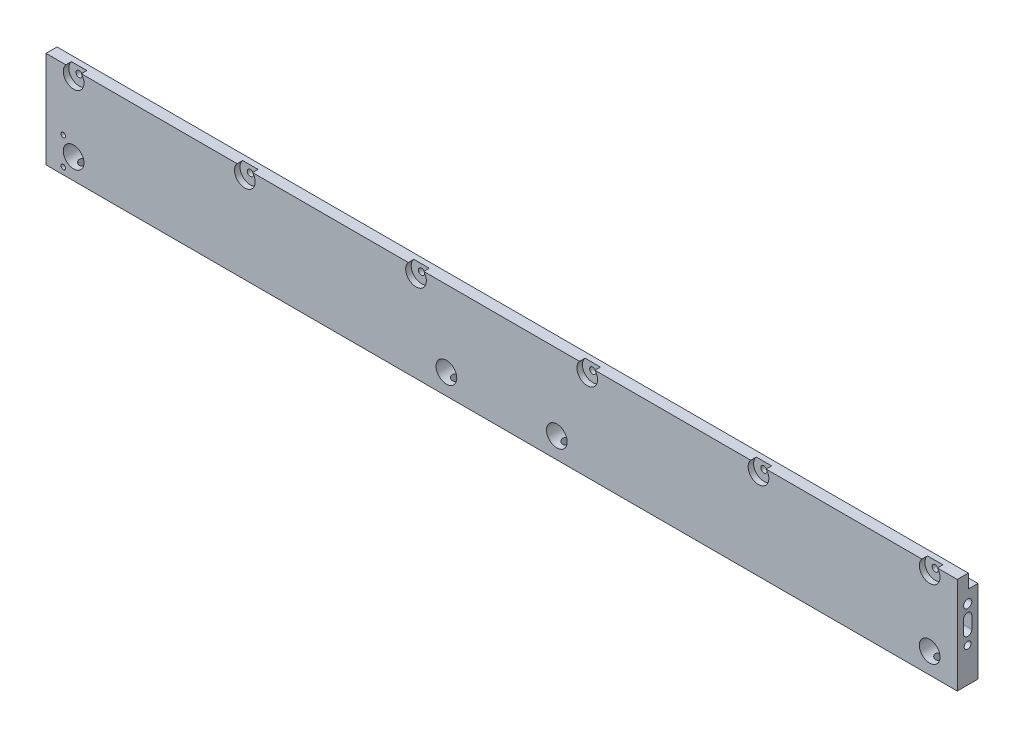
from build123d import *

# Parameters (mm, degrees)
EXTRUSION1_DEPTH                                   = 330
D_GAGEMENT_M61_D                                   = 15
D_GAGEMENT_M61_DEPTH                               = 60
D_GAGEMENT_M61_TIP                                 = 4.506454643
D_GAGEMENT_M62_REACH                               = 339.676
D_GAGEMENT_M62_BORE_R                              = 3.25
TROU_TARAUD_M6X1_01_D                              = 5
TROU_TARAUD_M6X1_01_DEPTH                          = 18
TROU_TARAUD_M6X1_01_TIP                            = 1.502151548
TROU_TARAUD_M4X0_71_D                              = 3.3
CHAMBRAGE_POUR_VIS_T_TE_HEXAGONALE_M61_D           = 4.5
CHAMBRAGE_POUR_VIS_T_TE_HEXAGONALE_M61_CBORE_D     = 15
CHAMBRAGE_POUR_VIS_T_TE_HEXAGONALE_M61_CBORE_DEPTH = 4
ENL_V_MAT_EXTRU_1_REACH                            = 665.871
ESQUISSE12_R                                       = 3
TROU_TARAUD_M6X1_03_D                              = 5
TROU_TARAUD_M6X1_03_DEPTH                          = 9
TROU_TARAUD_M6X1_03_TIP                            = 1.502151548


with BuildPart() as part:
    # Esquisse1 → Extrusion1 (new, symmetric)
    with BuildSketch(Plane(origin=(0, 0, 0), x_dir=(0, 0, -1), z_dir=(1, 0, 0))):
        Polygon((0, 0), (0, 70), (8, 70), (8, 60), (15, 60), (15, 0), align=None)
    extrude(amount=EXTRUSION1_DEPTH, both=True)

    # D_gagement M61
    with Locations(Plane(origin=(0, 0, -15), x_dir=(-1, 0, 0), z_dir=(0, 0, -1))):
        with Locations((-310, 15), (-40, 15), (40, 15), (310, 15)):
            Hole(D_GAGEMENT_M61_D / 2, depth=D_GAGEMENT_M61_DEPTH)
            with Locations((0, 0, -(D_GAGEMENT_M61_DEPTH + D_GAGEMENT_M61_TIP / 2))):  # 118° drill point
                Cone(0, D_GAGEMENT_M61_D / 2, D_GAGEMENT_M61_TIP, mode=Mode.SUBTRACT)

    # D_gagement M62 bore → D_gagement M62 (cut, up to next)
    with BuildSketch(Plane.XZ, mode=Mode.PRIVATE) as d_gagement_m62_sk1:
        with Locations((310, -7.5)):
            Circle(D_GAGEMENT_M62_BORE_R)
    d_gagement_m62_tool1 = extrude(d_gagement_m62_sk1.sketch, amount=-D_GAGEMENT_M62_REACH, mode=Mode.PRIVATE) & part.part
    # D_gagement M62 bore → D_gagement M62 (cut, up to next)
    with BuildSketch(Plane.XZ, mode=Mode.PRIVATE) as d_gagement_m62_sk2:
        with Locations((40, -7.5)):
            Circle(D_GAGEMENT_M62_BORE_R)
    d_gagement_m62_tool2 = extrude(d_gagement_m62_sk2.sketch, amount=-D_GAGEMENT_M62_REACH, mode=Mode.PRIVATE) & part.part
    # D_gagement M62 bore → D_gagement M62 (cut, up to next)
    with BuildSketch(Plane.XZ, mode=Mode.PRIVATE) as d_gagement_m62_sk3:
        with Locations((-40, -7.5)):
            Circle(D_GAGEMENT_M62_BORE_R)
    d_gagement_m62_tool3 = extrude(d_gagement_m62_sk3.sketch, amount=-D_GAGEMENT_M62_REACH, mode=Mode.PRIVATE) & part.part
    # D_gagement M62 bore → D_gagement M62 (cut, up to next)
    with BuildSketch(Plane.XZ, mode=Mode.PRIVATE) as d_gagement_m62_sk4:
        with Locations((-310, -7.5)):
            Circle(D_GAGEMENT_M62_BORE_R)
    d_gagement_m62_tool4 = extrude(d_gagement_m62_sk4.sketch, amount=-D_GAGEMENT_M62_REACH, mode=Mode.PRIVATE) & part.part
    add(d_gagement_m62_tool1.solids().sort_by_distance((310, 0, -7.5))[0], mode=Mode.SUBTRACT)
    add(d_gagement_m62_tool2.solids().sort_by_distance((40, 0, -7.5))[0], mode=Mode.SUBTRACT)
    add(d_gagement_m62_tool3.solids().sort_by_distance((-40, 0, -7.5))[0], mode=Mode.SUBTRACT)
    add(d_gagement_m62_tool4.solids().sort_by_distance((-310, 0, -7.5))[0], mode=Mode.SUBTRACT)

    # Trou taraud_ M6x1.01
    with Locations(Plane(origin=(330, 0, 0), x_dir=(0, 0, -1), z_dir=(1, 0, 0))):
        with Locations((7.5, 25)):
            Hole(TROU_TARAUD_M6X1_01_D / 2, depth=TROU_TARAUD_M6X1_01_DEPTH)
            with Locations((0, 0, -(TROU_TARAUD_M6X1_01_DEPTH + TROU_TARAUD_M6X1_01_TIP / 2))):  # 118° drill point
                Cone(0, TROU_TARAUD_M6X1_01_D / 2, TROU_TARAUD_M6X1_01_TIP, mode=Mode.SUBTRACT)

    # Trou taraud_ M4x0.71 (through all)
    with Locations(Plane(origin=(0, 0, -15), x_dir=(-1, 0, 0), z_dir=(0, 0, -1))):
        with Locations((317.5, 25), (317.5, 5)):
            Hole(TROU_TARAUD_M4X0_71_D / 2)

    # Chambrage pour vis _ t_te hexagonale M61 (through all)
    with Locations(Plane.XY):
        with Locations((186, 65), (310, 65), (62, 65), (-62, 65), (-186, 65), (-310, 65)):
            CounterBoreHole(CHAMBRAGE_POUR_VIS_T_TE_HEXAGONALE_M61_D / 2, CHAMBRAGE_POUR_VIS_T_TE_HEXAGONALE_M61_CBORE_D / 2, CHAMBRAGE_POUR_VIS_T_TE_HEXAGONALE_M61_CBORE_DEPTH)

    # Esquisse12 → Enl_v. mat.-Extru.1 (cut, up to next)
    with BuildSketch(Plane.ZY.offset(330), mode=Mode.PRIVATE) as enl_v_mat_extru_1_sk1:
        with Locations((-7.5, 51)):
            Circle(ESQUISSE12_R)
    enl_v_mat_extru_1_tool1 = extrude(enl_v_mat_extru_1_sk1.sketch, amount=-ENL_V_MAT_EXTRU_1_REACH, mode=Mode.PRIVATE) & part.part
    # Esquisse12 → Enl_v. mat.-Extru.1 (cut, up to next)
    with BuildSketch(Plane.ZY.offset(330), mode=Mode.PRIVATE) as enl_v_mat_extru_1_sk2:
        with BuildLine():
            Line((-10.5, 33.5), (-10.5, 42.5))
            ThreePointArc((-10.5, 42.5), (-7.5, 45.5), (-4.5, 42.5))
            Line((-4.5, 42.5), (-4.5, 33.5))
            ThreePointArc((-4.5, 33.5), (-7.5, 30.5), (-10.5, 33.5))
        make_face()
    enl_v_mat_extru_1_tool2 = extrude(enl_v_mat_extru_1_sk2.sketch, amount=-ENL_V_MAT_EXTRU_1_REACH, mode=Mode.PRIVATE) & part.part
    add(enl_v_mat_extru_1_tool1.solids().sort_by_distance((-330, 51, -7.5))[0], mode=Mode.SUBTRACT)
    add(enl_v_mat_extru_1_tool2.solids().sort_by_distance((-330, 38, -7.5))[0], mode=Mode.SUBTRACT)

    # Trou taraud_ M6x1.03
    with Locations(Plane(origin=(-330, 25, -7.5), x_dir=(0, 0, -1), z_dir=(-1, 0, 0))):
        with Locations((0, 0), (0, 20)):
            Hole(TROU_TARAUD_M6X1_03_D / 2, depth=TROU_TARAUD_M6X1_03_DEPTH)
            with Locations((0, 0, -(TROU_TARAUD_M6X1_03_DEPTH + TROU_TARAUD_M6X1_03_TIP / 2))):  # 118° drill point
                Cone(0, TROU_TARAUD_M6X1_03_D / 2, TROU_TARAUD_M6X1_03_TIP, mode=Mode.SUBTRACT)


solid = part.part
